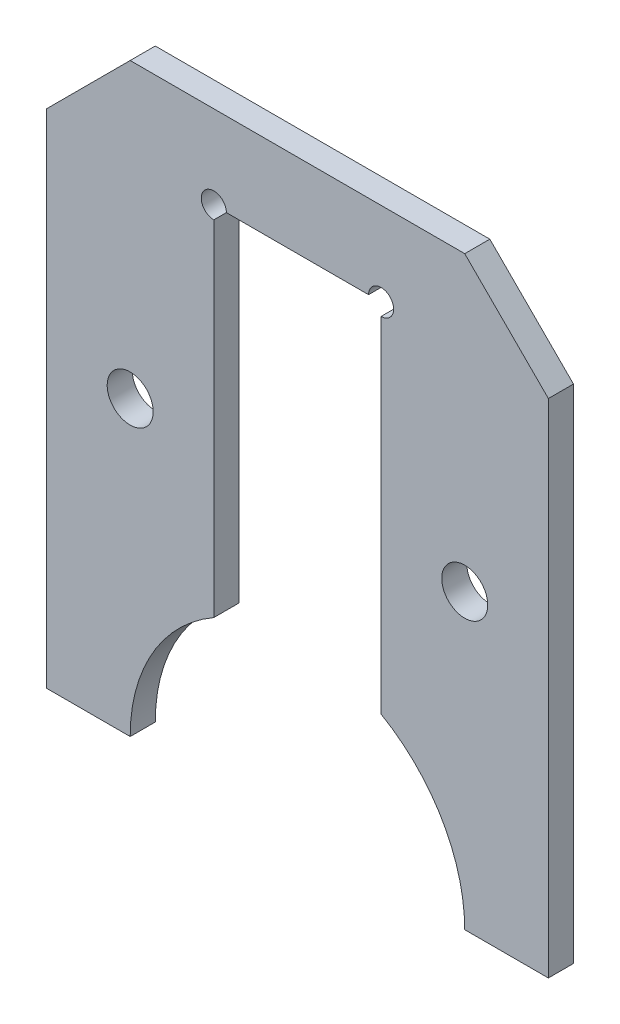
ISO-10303-21;
HEADER;
FILE_DESCRIPTION(('STEP AP214'),'2;1');
FILE_NAME('part.step','',(''),(''),'','','');
FILE_SCHEMA(('AUTOMOTIVE_DESIGN { 1 0 10303 214 1 1 1 1 }'));
ENDSEC;
DATA;
#1=APPLICATION_CONTEXT('core data for automotive mechanical design processes');
#2=APPLICATION_PROTOCOL_DEFINITION('international standard','automotive_design',2000,#1);
#3=PRODUCT_CONTEXT('',#1,'mechanical');
#4=PRODUCT('Part','Part','',(#3));
#5=PRODUCT_RELATED_PRODUCT_CATEGORY('part','',(#4));
#6=PRODUCT_DEFINITION_FORMATION('','',#4);
#7=PRODUCT_DEFINITION_CONTEXT('part definition',#1,'design');
#8=PRODUCT_DEFINITION('design','',#6,#7);
#9=PRODUCT_DEFINITION_SHAPE('','',#8);
#10=(LENGTH_UNIT() NAMED_UNIT(*) SI_UNIT(.MILLI.,.METRE.));
#11=(NAMED_UNIT(*) PLANE_ANGLE_UNIT() SI_UNIT($,.RADIAN.));
#12=(NAMED_UNIT(*) SI_UNIT($,.STERADIAN.) SOLID_ANGLE_UNIT());
#13=UNCERTAINTY_MEASURE_WITH_UNIT(LENGTH_MEASURE(1.E-05),#10,'distance_accuracy_value','');
#14=(GEOMETRIC_REPRESENTATION_CONTEXT(3) GLOBAL_UNCERTAINTY_ASSIGNED_CONTEXT((#13)) GLOBAL_UNIT_ASSIGNED_CONTEXT((#10,
#11,#12)) REPRESENTATION_CONTEXT('',''));
#15=CARTESIAN_POINT('',(0.,0.,0.));
#16=DIRECTION('',(0.,0.,1.));
#17=DIRECTION('',(1.,0.,0.));
#18=AXIS2_PLACEMENT_3D('',#15,#16,#17);
#19=CARTESIAN_POINT('',(0.,0.,3.));
#20=DIRECTION('',(0.,0.,1.));
#21=DIRECTION('',(1.,0.,0.));
#22=AXIS2_PLACEMENT_3D('',#19,#20,#21);
#23=PLANE('',#22);
#24=CARTESIAN_POINT('',(20.,35.,3.));
#25=DIRECTION('',(0.,0.,1.));
#26=DIRECTION('',(1.,0.,0.));
#27=AXIS2_PLACEMENT_3D('',#24,#25,#26);
#28=CIRCLE('',#27,2.75);
#29=CARTESIAN_POINT('',(22.75,35.,3.));
#30=VERTEX_POINT('',#29);
#31=EDGE_CURVE('E168',#30,#30,#28,.T.);
#32=ORIENTED_EDGE('',*,*,#31,.F.);
#33=EDGE_LOOP('',(#32));
#34=FACE_BOUND('',#33,.T.);
#35=CARTESIAN_POINT('',(0.,0.,3.));
#36=DIRECTION('',(0.,0.,-1.));
#37=DIRECTION('',(1.,0.,0.));
#38=AXIS2_PLACEMENT_3D('',#35,#36,#37);
#39=CIRCLE('',#38,20.);
#40=CARTESIAN_POINT('',(10.,17.3205080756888,3.));
#41=VERTEX_POINT('',#40);
#42=CARTESIAN_POINT('',(20.,0.,3.));
#43=VERTEX_POINT('',#42);
#44=EDGE_CURVE('E191',#41,#43,#39,.T.);
#45=ORIENTED_EDGE('',*,*,#44,.T.);
#46=DIRECTION('',(1.,0.,0.));
#47=VECTOR('',#46,1.);
#48=CARTESIAN_POINT('',(30.,0.,3.));
#49=LINE('',#48,#47);
#50=CARTESIAN_POINT('',(30.,0.,3.));
#51=VERTEX_POINT('',#50);
#52=EDGE_CURVE('E109',#43,#51,#49,.T.);
#53=ORIENTED_EDGE('',*,*,#52,.T.);
#54=DIRECTION('',(0.,1.,0.));
#55=VECTOR('',#54,1.);
#56=CARTESIAN_POINT('',(30.,60.,3.));
#57=LINE('',#56,#55);
#58=CARTESIAN_POINT('',(30.,60.,3.));
#59=VERTEX_POINT('',#58);
#60=EDGE_CURVE('E224',#51,#59,#57,.T.);
#61=ORIENTED_EDGE('',*,*,#60,.T.);
#62=DIRECTION('',(-0.707106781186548,0.707106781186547,0.));
#63=VECTOR('',#62,1.);
#64=CARTESIAN_POINT('',(20.,70.,3.));
#65=LINE('',#64,#63);
#66=CARTESIAN_POINT('',(20.,70.,3.));
#67=VERTEX_POINT('',#66);
#68=EDGE_CURVE('E243',#59,#67,#65,.T.);
#69=ORIENTED_EDGE('',*,*,#68,.T.);
#70=DIRECTION('',(-1.,0.,0.));
#71=VECTOR('',#70,1.);
#72=CARTESIAN_POINT('',(-20.,70.,3.));
#73=LINE('',#72,#71);
#74=CARTESIAN_POINT('',(-20.,70.,3.));
#75=VERTEX_POINT('',#74);
#76=EDGE_CURVE('E240',#67,#75,#73,.T.);
#77=ORIENTED_EDGE('',*,*,#76,.T.);
#78=DIRECTION('',(-0.707106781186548,-0.707106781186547,0.));
#79=VECTOR('',#78,1.);
#80=CARTESIAN_POINT('',(-20.,70.,3.));
#81=LINE('',#80,#79);
#82=CARTESIAN_POINT('',(-30.,60.,3.));
#83=VERTEX_POINT('',#82);
#84=EDGE_CURVE('E242',#75,#83,#81,.T.);
#85=ORIENTED_EDGE('',*,*,#84,.T.);
#86=DIRECTION('',(0.,-1.,0.));
#87=VECTOR('',#86,1.);
#88=CARTESIAN_POINT('',(-30.,60.,3.));
#89=LINE('',#88,#87);
#90=CARTESIAN_POINT('',(-30.,0.,3.));
#91=VERTEX_POINT('',#90);
#92=EDGE_CURVE('E245',#83,#91,#89,.T.);
#93=ORIENTED_EDGE('',*,*,#92,.T.);
#94=DIRECTION('',(1.,0.,0.));
#95=VECTOR('',#94,1.);
#96=CARTESIAN_POINT('',(-30.,0.,3.));
#97=LINE('',#96,#95);
#98=CARTESIAN_POINT('',(-20.,0.,3.));
#99=VERTEX_POINT('',#98);
#100=EDGE_CURVE('E251',#91,#99,#97,.T.);
#101=ORIENTED_EDGE('',*,*,#100,.T.);
#102=CARTESIAN_POINT('',(0.,0.,3.));
#103=DIRECTION('',(0.,0.,-1.));
#104=DIRECTION('',(-1.,0.,0.));
#105=AXIS2_PLACEMENT_3D('',#102,#103,#104);
#106=CIRCLE('',#105,20.);
#107=CARTESIAN_POINT('',(-10.,17.3205080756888,3.));
#108=VERTEX_POINT('',#107);
#109=EDGE_CURVE('E253',#99,#108,#106,.T.);
#110=ORIENTED_EDGE('',*,*,#109,.T.);
#111=DIRECTION('',(0.,1.,0.));
#112=VECTOR('',#111,1.);
#113=CARTESIAN_POINT('',(-10.,17.3205080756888,3.));
#114=LINE('',#113,#112);
#115=CARTESIAN_POINT('',(-10.,58.5,3.));
#116=VERTEX_POINT('',#115);
#117=EDGE_CURVE('E255',#108,#116,#114,.T.);
#118=ORIENTED_EDGE('',*,*,#117,.T.);
#119=CARTESIAN_POINT('',(-10.,60.,3.));
#120=DIRECTION('',(0.,0.,-1.));
#121=DIRECTION('',(-1.,0.,0.));
#122=AXIS2_PLACEMENT_3D('',#119,#120,#121);
#123=CIRCLE('',#122,1.5);
#124=CARTESIAN_POINT('',(-8.5,60.,3.));
#125=VERTEX_POINT('',#124);
#126=EDGE_CURVE('E146',#116,#125,#123,.T.);
#127=ORIENTED_EDGE('',*,*,#126,.T.);
#128=DIRECTION('',(1.,0.,0.));
#129=VECTOR('',#128,1.);
#130=CARTESIAN_POINT('',(8.5,60.,3.));
#131=LINE('',#130,#129);
#132=CARTESIAN_POINT('',(8.5,60.,3.));
#133=VERTEX_POINT('',#132);
#134=EDGE_CURVE('E140',#125,#133,#131,.T.);
#135=ORIENTED_EDGE('',*,*,#134,.T.);
#136=CARTESIAN_POINT('',(10.,60.,3.));
#137=DIRECTION('',(0.,0.,-1.));
#138=DIRECTION('',(1.,0.,0.));
#139=AXIS2_PLACEMENT_3D('',#136,#137,#138);
#140=CIRCLE('',#139,1.5);
#141=CARTESIAN_POINT('',(10.,58.5,3.));
#142=VERTEX_POINT('',#141);
#143=EDGE_CURVE('E144',#133,#142,#140,.T.);
#144=ORIENTED_EDGE('',*,*,#143,.T.);
#145=DIRECTION('',(0.,-1.,0.));
#146=VECTOR('',#145,1.);
#147=CARTESIAN_POINT('',(10.,17.3205080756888,3.));
#148=LINE('',#147,#146);
#149=EDGE_CURVE('E48',#142,#41,#148,.T.);
#150=ORIENTED_EDGE('',*,*,#149,.T.);
#151=EDGE_LOOP('',(#45,#53,#61,#69,#77,#85,#93,#101,#110,#118,#127,#135,#144,#150));
#152=FACE_BOUND('',#151,.T.);
#153=CARTESIAN_POINT('',(-20.,35.,3.));
#154=DIRECTION('',(0.,0.,1.));
#155=DIRECTION('',(-1.,0.,0.));
#156=AXIS2_PLACEMENT_3D('',#153,#154,#155);
#157=CIRCLE('',#156,2.75);
#158=CARTESIAN_POINT('',(-22.75,35.,3.));
#159=VERTEX_POINT('',#158);
#160=EDGE_CURVE('E298',#159,#159,#157,.T.);
#161=ORIENTED_EDGE('',*,*,#160,.F.);
#162=EDGE_LOOP('',(#161));
#163=FACE_BOUND('',#162,.T.);
#164=ADVANCED_FACE('F31',(#34,#152,#163),#23,.T.);
#165=CARTESIAN_POINT('',(0.,0.,0.));
#166=DIRECTION('',(0.,0.,1.));
#167=DIRECTION('',(1.,0.,0.));
#168=AXIS2_PLACEMENT_3D('',#165,#166,#167);
#169=PLANE('',#168);
#170=CARTESIAN_POINT('',(20.,35.,0.));
#171=DIRECTION('',(0.,0.,1.));
#172=DIRECTION('',(1.,0.,0.));
#173=AXIS2_PLACEMENT_3D('',#170,#171,#172);
#174=CIRCLE('',#173,2.75);
#175=CARTESIAN_POINT('',(22.75,35.,0.));
#176=VERTEX_POINT('',#175);
#177=EDGE_CURVE('E303',#176,#176,#174,.T.);
#178=ORIENTED_EDGE('',*,*,#177,.T.);
#179=EDGE_LOOP('',(#178));
#180=FACE_BOUND('',#179,.T.);
#181=CARTESIAN_POINT('',(0.,0.,0.));
#182=DIRECTION('',(0.,0.,-1.));
#183=DIRECTION('',(1.,0.,0.));
#184=AXIS2_PLACEMENT_3D('',#181,#182,#183);
#185=CIRCLE('',#184,20.);
#186=CARTESIAN_POINT('',(10.,17.3205080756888,0.));
#187=VERTEX_POINT('',#186);
#188=CARTESIAN_POINT('',(20.,0.,0.));
#189=VERTEX_POINT('',#188);
#190=EDGE_CURVE('E164',#187,#189,#185,.T.);
#191=ORIENTED_EDGE('',*,*,#190,.F.);
#192=DIRECTION('',(0.,-1.,0.));
#193=VECTOR('',#192,1.);
#194=CARTESIAN_POINT('',(10.,17.3205080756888,0.));
#195=LINE('',#194,#193);
#196=CARTESIAN_POINT('',(10.,58.5,0.));
#197=VERTEX_POINT('',#196);
#198=EDGE_CURVE('E101',#197,#187,#195,.T.);
#199=ORIENTED_EDGE('',*,*,#198,.F.);
#200=CARTESIAN_POINT('',(10.,60.,0.));
#201=DIRECTION('',(0.,0.,-1.));
#202=DIRECTION('',(1.,0.,0.));
#203=AXIS2_PLACEMENT_3D('',#200,#201,#202);
#204=CIRCLE('',#203,1.5);
#205=CARTESIAN_POINT('',(8.5,60.,0.));
#206=VERTEX_POINT('',#205);
#207=EDGE_CURVE('E95',#206,#197,#204,.T.);
#208=ORIENTED_EDGE('',*,*,#207,.F.);
#209=DIRECTION('',(1.,0.,0.));
#210=VECTOR('',#209,1.);
#211=CARTESIAN_POINT('',(8.5,60.,0.));
#212=LINE('',#211,#210);
#213=CARTESIAN_POINT('',(-8.5,60.,0.));
#214=VERTEX_POINT('',#213);
#215=EDGE_CURVE('E154',#214,#206,#212,.T.);
#216=ORIENTED_EDGE('',*,*,#215,.F.);
#217=CARTESIAN_POINT('',(-10.,60.,0.));
#218=DIRECTION('',(0.,0.,-1.));
#219=DIRECTION('',(-1.,0.,0.));
#220=AXIS2_PLACEMENT_3D('',#217,#218,#219);
#221=CIRCLE('',#220,1.5);
#222=CARTESIAN_POINT('',(-10.,58.5,0.));
#223=VERTEX_POINT('',#222);
#224=EDGE_CURVE('E186',#223,#214,#221,.T.);
#225=ORIENTED_EDGE('',*,*,#224,.F.);
#226=DIRECTION('',(0.,1.,0.));
#227=VECTOR('',#226,1.);
#228=CARTESIAN_POINT('',(-10.,17.3205080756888,0.));
#229=LINE('',#228,#227);
#230=CARTESIAN_POINT('',(-10.,17.3205080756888,0.));
#231=VERTEX_POINT('',#230);
#232=EDGE_CURVE('E184',#231,#223,#229,.T.);
#233=ORIENTED_EDGE('',*,*,#232,.F.);
#234=CARTESIAN_POINT('',(0.,0.,0.));
#235=DIRECTION('',(0.,0.,-1.));
#236=DIRECTION('',(-1.,0.,0.));
#237=AXIS2_PLACEMENT_3D('',#234,#235,#236);
#238=CIRCLE('',#237,20.);
#239=CARTESIAN_POINT('',(-20.,0.,0.));
#240=VERTEX_POINT('',#239);
#241=EDGE_CURVE('E182',#240,#231,#238,.T.);
#242=ORIENTED_EDGE('',*,*,#241,.F.);
#243=DIRECTION('',(1.,0.,0.));
#244=VECTOR('',#243,1.);
#245=CARTESIAN_POINT('',(-30.,0.,0.));
#246=LINE('',#245,#244);
#247=CARTESIAN_POINT('',(-30.,0.,0.));
#248=VERTEX_POINT('',#247);
#249=EDGE_CURVE('E180',#248,#240,#246,.T.);
#250=ORIENTED_EDGE('',*,*,#249,.F.);
#251=DIRECTION('',(0.,-1.,0.));
#252=VECTOR('',#251,1.);
#253=CARTESIAN_POINT('',(-30.,60.,0.));
#254=LINE('',#253,#252);
#255=CARTESIAN_POINT('',(-30.,60.,0.));
#256=VERTEX_POINT('',#255);
#257=EDGE_CURVE('E178',#256,#248,#254,.T.);
#258=ORIENTED_EDGE('',*,*,#257,.F.);
#259=DIRECTION('',(-0.707106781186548,-0.707106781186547,0.));
#260=VECTOR('',#259,1.);
#261=CARTESIAN_POINT('',(-20.,70.,0.));
#262=LINE('',#261,#260);
#263=CARTESIAN_POINT('',(-20.,70.,0.));
#264=VERTEX_POINT('',#263);
#265=EDGE_CURVE('E176',#264,#256,#262,.T.);
#266=ORIENTED_EDGE('',*,*,#265,.F.);
#267=DIRECTION('',(-1.,0.,0.));
#268=VECTOR('',#267,1.);
#269=CARTESIAN_POINT('',(-20.,70.,0.));
#270=LINE('',#269,#268);
#271=CARTESIAN_POINT('',(20.,70.,0.));
#272=VERTEX_POINT('',#271);
#273=EDGE_CURVE('E174',#272,#264,#270,.T.);
#274=ORIENTED_EDGE('',*,*,#273,.F.);
#275=DIRECTION('',(-0.707106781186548,0.707106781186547,0.));
#276=VECTOR('',#275,1.);
#277=CARTESIAN_POINT('',(20.,70.,0.));
#278=LINE('',#277,#276);
#279=CARTESIAN_POINT('',(30.,60.,0.));
#280=VERTEX_POINT('',#279);
#281=EDGE_CURVE('E172',#280,#272,#278,.T.);
#282=ORIENTED_EDGE('',*,*,#281,.F.);
#283=DIRECTION('',(0.,1.,0.));
#284=VECTOR('',#283,1.);
#285=CARTESIAN_POINT('',(30.,60.,0.));
#286=LINE('',#285,#284);
#287=CARTESIAN_POINT('',(30.,0.,0.));
#288=VERTEX_POINT('',#287);
#289=EDGE_CURVE('E170',#288,#280,#286,.T.);
#290=ORIENTED_EDGE('',*,*,#289,.F.);
#291=DIRECTION('',(1.,0.,0.));
#292=VECTOR('',#291,1.);
#293=CARTESIAN_POINT('',(30.,0.,0.));
#294=LINE('',#293,#292);
#295=EDGE_CURVE('E167',#189,#288,#294,.T.);
#296=ORIENTED_EDGE('',*,*,#295,.F.);
#297=EDGE_LOOP('',(#191,#199,#208,#216,#225,#233,#242,#250,#258,#266,#274,#282,#290,#296));
#298=FACE_BOUND('',#297,.T.);
#299=CARTESIAN_POINT('',(-20.,35.,0.));
#300=DIRECTION('',(0.,0.,1.));
#301=DIRECTION('',(-1.,0.,0.));
#302=AXIS2_PLACEMENT_3D('',#299,#300,#301);
#303=CIRCLE('',#302,2.75);
#304=CARTESIAN_POINT('',(-22.75,35.,0.));
#305=VERTEX_POINT('',#304);
#306=EDGE_CURVE('E301',#305,#305,#303,.T.);
#307=ORIENTED_EDGE('',*,*,#306,.T.);
#308=EDGE_LOOP('',(#307));
#309=FACE_BOUND('',#308,.T.);
#310=ADVANCED_FACE('F228',(#180,#298,#309),#169,.F.);
#311=CARTESIAN_POINT('',(0.,0.,3.));
#312=DIRECTION('',(0.,0.,-1.));
#313=DIRECTION('',(-1.,0.,0.));
#314=AXIS2_PLACEMENT_3D('',#311,#312,#313);
#315=CYLINDRICAL_SURFACE('',#314,20.);
#316=ORIENTED_EDGE('',*,*,#190,.T.);
#317=DIRECTION('',(0.,0.,-1.));
#318=VECTOR('',#317,1.);
#319=CARTESIAN_POINT('',(20.,0.,3.));
#320=LINE('',#319,#318);
#321=EDGE_CURVE('E11',#43,#189,#320,.T.);
#322=ORIENTED_EDGE('',*,*,#321,.F.);
#323=ORIENTED_EDGE('',*,*,#44,.F.);
#324=DIRECTION('',(0.,0.,-1.));
#325=VECTOR('',#324,1.);
#326=CARTESIAN_POINT('',(10.,17.3205080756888,3.));
#327=LINE('',#326,#325);
#328=EDGE_CURVE('E160',#41,#187,#327,.T.);
#329=ORIENTED_EDGE('',*,*,#328,.T.);
#330=EDGE_LOOP('',(#316,#322,#323,#329));
#331=FACE_BOUND('',#330,.T.);
#332=ADVANCED_FACE('F33',(#331),#315,.F.);
#333=CARTESIAN_POINT('',(30.,0.,3.));
#334=DIRECTION('',(0.,1.,0.));
#335=DIRECTION('',(-1.,0.,0.));
#336=AXIS2_PLACEMENT_3D('',#333,#334,#335);
#337=PLANE('',#336);
#338=ORIENTED_EDGE('',*,*,#295,.T.);
#339=DIRECTION('',(0.,0.,-1.));
#340=VECTOR('',#339,1.);
#341=CARTESIAN_POINT('',(30.,0.,3.));
#342=LINE('',#341,#340);
#343=EDGE_CURVE('E40',#51,#288,#342,.T.);
#344=ORIENTED_EDGE('',*,*,#343,.F.);
#345=ORIENTED_EDGE('',*,*,#52,.F.);
#346=ORIENTED_EDGE('',*,*,#321,.T.);
#347=EDGE_LOOP('',(#338,#344,#345,#346));
#348=FACE_BOUND('',#347,.T.);
#349=ADVANCED_FACE('F416',(#348),#337,.F.);
#350=CARTESIAN_POINT('',(30.,60.,3.));
#351=DIRECTION('',(-1.,0.,0.));
#352=DIRECTION('',(0.,-1.,0.));
#353=AXIS2_PLACEMENT_3D('',#350,#351,#352);
#354=PLANE('',#353);
#355=ORIENTED_EDGE('',*,*,#289,.T.);
#356=DIRECTION('',(0.,0.,-1.));
#357=VECTOR('',#356,1.);
#358=CARTESIAN_POINT('',(30.,60.,3.));
#359=LINE('',#358,#357);
#360=EDGE_CURVE('E216',#59,#280,#359,.T.);
#361=ORIENTED_EDGE('',*,*,#360,.F.);
#362=ORIENTED_EDGE('',*,*,#60,.F.);
#363=ORIENTED_EDGE('',*,*,#343,.T.);
#364=EDGE_LOOP('',(#355,#361,#362,#363));
#365=FACE_BOUND('',#364,.T.);
#366=ADVANCED_FACE('F222',(#365),#354,.F.);
#367=CARTESIAN_POINT('',(20.,70.,3.));
#368=DIRECTION('',(-0.707106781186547,-0.707106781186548,0.));
#369=DIRECTION('',(0.707106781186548,-0.707106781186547,0.));
#370=AXIS2_PLACEMENT_3D('',#367,#368,#369);
#371=PLANE('',#370);
#372=ORIENTED_EDGE('',*,*,#281,.T.);
#373=DIRECTION('',(0.,0.,-1.));
#374=VECTOR('',#373,1.);
#375=CARTESIAN_POINT('',(20.,70.,3.));
#376=LINE('',#375,#374);
#377=EDGE_CURVE('E213',#67,#272,#376,.T.);
#378=ORIENTED_EDGE('',*,*,#377,.F.);
#379=ORIENTED_EDGE('',*,*,#68,.F.);
#380=ORIENTED_EDGE('',*,*,#360,.T.);
#381=EDGE_LOOP('',(#372,#378,#379,#380));
#382=FACE_BOUND('',#381,.T.);
#383=ADVANCED_FACE('F234',(#382),#371,.F.);
#384=CARTESIAN_POINT('',(-20.,70.,3.));
#385=DIRECTION('',(0.,-1.,0.));
#386=DIRECTION('',(0.,0.,-1.));
#387=AXIS2_PLACEMENT_3D('',#384,#385,#386);
#388=PLANE('',#387);
#389=ORIENTED_EDGE('',*,*,#273,.T.);
#390=DIRECTION('',(0.,0.,-1.));
#391=VECTOR('',#390,1.);
#392=CARTESIAN_POINT('',(-20.,70.,3.));
#393=LINE('',#392,#391);
#394=EDGE_CURVE('E210',#75,#264,#393,.T.);
#395=ORIENTED_EDGE('',*,*,#394,.F.);
#396=ORIENTED_EDGE('',*,*,#76,.F.);
#397=ORIENTED_EDGE('',*,*,#377,.T.);
#398=EDGE_LOOP('',(#389,#395,#396,#397));
#399=FACE_BOUND('',#398,.T.);
#400=ADVANCED_FACE('F238',(#399),#388,.F.);
#401=CARTESIAN_POINT('',(-20.,70.,3.));
#402=DIRECTION('',(0.707106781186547,-0.707106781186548,0.));
#403=DIRECTION('',(0.707106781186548,0.707106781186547,0.));
#404=AXIS2_PLACEMENT_3D('',#401,#402,#403);
#405=PLANE('',#404);
#406=ORIENTED_EDGE('',*,*,#265,.T.);
#407=DIRECTION('',(0.,0.,-1.));
#408=VECTOR('',#407,1.);
#409=CARTESIAN_POINT('',(-30.,60.,3.));
#410=LINE('',#409,#408);
#411=EDGE_CURVE('E207',#83,#256,#410,.T.);
#412=ORIENTED_EDGE('',*,*,#411,.F.);
#413=ORIENTED_EDGE('',*,*,#84,.F.);
#414=ORIENTED_EDGE('',*,*,#394,.T.);
#415=EDGE_LOOP('',(#406,#412,#413,#414));
#416=FACE_BOUND('',#415,.T.);
#417=ADVANCED_FACE('F381',(#416),#405,.F.);
#418=CARTESIAN_POINT('',(-30.,60.,3.));
#419=DIRECTION('',(1.,0.,0.));
#420=DIRECTION('',(0.,1.,0.));
#421=AXIS2_PLACEMENT_3D('',#418,#419,#420);
#422=PLANE('',#421);
#423=ORIENTED_EDGE('',*,*,#257,.T.);
#424=DIRECTION('',(0.,0.,-1.));
#425=VECTOR('',#424,1.);
#426=CARTESIAN_POINT('',(-30.,0.,3.));
#427=LINE('',#426,#425);
#428=EDGE_CURVE('E204',#91,#248,#427,.T.);
#429=ORIENTED_EDGE('',*,*,#428,.F.);
#430=ORIENTED_EDGE('',*,*,#92,.F.);
#431=ORIENTED_EDGE('',*,*,#411,.T.);
#432=EDGE_LOOP('',(#423,#429,#430,#431));
#433=FACE_BOUND('',#432,.T.);
#434=ADVANCED_FACE('F371',(#433),#422,.F.);
#435=CARTESIAN_POINT('',(-30.,0.,3.));
#436=DIRECTION('',(0.,1.,0.));
#437=DIRECTION('',(-1.,0.,0.));
#438=AXIS2_PLACEMENT_3D('',#435,#436,#437);
#439=PLANE('',#438);
#440=ORIENTED_EDGE('',*,*,#249,.T.);
#441=DIRECTION('',(0.,0.,-1.));
#442=VECTOR('',#441,1.);
#443=CARTESIAN_POINT('',(-20.,0.,3.));
#444=LINE('',#443,#442);
#445=EDGE_CURVE('E201',#99,#240,#444,.T.);
#446=ORIENTED_EDGE('',*,*,#445,.F.);
#447=ORIENTED_EDGE('',*,*,#100,.F.);
#448=ORIENTED_EDGE('',*,*,#428,.T.);
#449=EDGE_LOOP('',(#440,#446,#447,#448));
#450=FACE_BOUND('',#449,.T.);
#451=ADVANCED_FACE('F361',(#450),#439,.F.);
#452=CARTESIAN_POINT('',(0.,0.,3.));
#453=DIRECTION('',(0.,0.,-1.));
#454=DIRECTION('',(-1.,0.,0.));
#455=AXIS2_PLACEMENT_3D('',#452,#453,#454);
#456=CYLINDRICAL_SURFACE('',#455,20.);
#457=ORIENTED_EDGE('',*,*,#241,.T.);
#458=DIRECTION('',(0.,0.,-1.));
#459=VECTOR('',#458,1.);
#460=CARTESIAN_POINT('',(-10.,17.3205080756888,3.));
#461=LINE('',#460,#459);
#462=EDGE_CURVE('E198',#108,#231,#461,.T.);
#463=ORIENTED_EDGE('',*,*,#462,.F.);
#464=ORIENTED_EDGE('',*,*,#109,.F.);
#465=ORIENTED_EDGE('',*,*,#445,.T.);
#466=EDGE_LOOP('',(#457,#463,#464,#465));
#467=FACE_BOUND('',#466,.T.);
#468=ADVANCED_FACE('F352',(#467),#456,.F.);
#469=CARTESIAN_POINT('',(-10.,17.3205080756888,3.));
#470=DIRECTION('',(-1.,0.,0.));
#471=DIRECTION('',(0.,0.,1.));
#472=AXIS2_PLACEMENT_3D('',#469,#470,#471);
#473=PLANE('',#472);
#474=ORIENTED_EDGE('',*,*,#232,.T.);
#475=DIRECTION('',(0.,0.,-1.));
#476=VECTOR('',#475,1.);
#477=CARTESIAN_POINT('',(-10.,58.5,3.));
#478=LINE('',#477,#476);
#479=EDGE_CURVE('E195',#116,#223,#478,.T.);
#480=ORIENTED_EDGE('',*,*,#479,.F.);
#481=ORIENTED_EDGE('',*,*,#117,.F.);
#482=ORIENTED_EDGE('',*,*,#462,.T.);
#483=EDGE_LOOP('',(#474,#480,#481,#482));
#484=FACE_BOUND('',#483,.T.);
#485=ADVANCED_FACE('F261',(#484),#473,.F.);
#486=CARTESIAN_POINT('',(-10.,60.,3.));
#487=DIRECTION('',(0.,0.,-1.));
#488=DIRECTION('',(-1.,0.,0.));
#489=AXIS2_PLACEMENT_3D('',#486,#487,#488);
#490=CYLINDRICAL_SURFACE('',#489,1.5);
#491=ORIENTED_EDGE('',*,*,#224,.T.);
#492=DIRECTION('',(0.,0.,-1.));
#493=VECTOR('',#492,1.);
#494=CARTESIAN_POINT('',(-8.5,60.,3.));
#495=LINE('',#494,#493);
#496=EDGE_CURVE('E155',#125,#214,#495,.T.);
#497=ORIENTED_EDGE('',*,*,#496,.F.);
#498=ORIENTED_EDGE('',*,*,#126,.F.);
#499=ORIENTED_EDGE('',*,*,#479,.T.);
#500=EDGE_LOOP('',(#491,#497,#498,#499));
#501=FACE_BOUND('',#500,.T.);
#502=ADVANCED_FACE('F265',(#501),#490,.F.);
#503=CARTESIAN_POINT('',(8.5,60.,3.));
#504=DIRECTION('',(0.,1.,0.));
#505=DIRECTION('',(0.,0.,1.));
#506=AXIS2_PLACEMENT_3D('',#503,#504,#505);
#507=PLANE('',#506);
#508=ORIENTED_EDGE('',*,*,#215,.T.);
#509=DIRECTION('',(0.,0.,-1.));
#510=VECTOR('',#509,1.);
#511=CARTESIAN_POINT('',(8.5,60.,3.));
#512=LINE('',#511,#510);
#513=EDGE_CURVE('E151',#133,#206,#512,.T.);
#514=ORIENTED_EDGE('',*,*,#513,.F.);
#515=ORIENTED_EDGE('',*,*,#134,.F.);
#516=ORIENTED_EDGE('',*,*,#496,.T.);
#517=EDGE_LOOP('',(#508,#514,#515,#516));
#518=FACE_BOUND('',#517,.T.);
#519=ADVANCED_FACE('F152',(#518),#507,.F.);
#520=CARTESIAN_POINT('',(10.,60.,3.));
#521=DIRECTION('',(0.,0.,-1.));
#522=DIRECTION('',(-1.,0.,0.));
#523=AXIS2_PLACEMENT_3D('',#520,#521,#522);
#524=CYLINDRICAL_SURFACE('',#523,1.5);
#525=ORIENTED_EDGE('',*,*,#207,.T.);
#526=DIRECTION('',(0.,0.,-1.));
#527=VECTOR('',#526,1.);
#528=CARTESIAN_POINT('',(10.,58.5,3.));
#529=LINE('',#528,#527);
#530=EDGE_CURVE('E156',#142,#197,#529,.T.);
#531=ORIENTED_EDGE('',*,*,#530,.F.);
#532=ORIENTED_EDGE('',*,*,#143,.F.);
#533=ORIENTED_EDGE('',*,*,#513,.T.);
#534=EDGE_LOOP('',(#525,#531,#532,#533));
#535=FACE_BOUND('',#534,.T.);
#536=ADVANCED_FACE('F158',(#535),#524,.F.);
#537=CARTESIAN_POINT('',(10.,17.3205080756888,3.));
#538=DIRECTION('',(1.,0.,0.));
#539=DIRECTION('',(0.,0.,-1.));
#540=AXIS2_PLACEMENT_3D('',#537,#538,#539);
#541=PLANE('',#540);
#542=ORIENTED_EDGE('',*,*,#198,.T.);
#543=ORIENTED_EDGE('',*,*,#328,.F.);
#544=ORIENTED_EDGE('',*,*,#149,.F.);
#545=ORIENTED_EDGE('',*,*,#530,.T.);
#546=EDGE_LOOP('',(#542,#543,#544,#545));
#547=FACE_BOUND('',#546,.T.);
#548=ADVANCED_FACE('F269',(#547),#541,.F.);
#549=CARTESIAN_POINT('',(20.,35.,3.));
#550=DIRECTION('',(0.,0.,-1.));
#551=DIRECTION('',(-1.,0.,0.));
#552=AXIS2_PLACEMENT_3D('',#549,#550,#551);
#553=CYLINDRICAL_SURFACE('',#552,2.75);
#554=ORIENTED_EDGE('',*,*,#31,.T.);
#555=EDGE_LOOP('',(#554));
#556=FACE_BOUND('',#555,.T.);
#557=ORIENTED_EDGE('',*,*,#177,.F.);
#558=EDGE_LOOP('',(#557));
#559=FACE_BOUND('',#558,.T.);
#560=ADVANCED_FACE('F271',(#556,#559),#553,.F.);
#561=CARTESIAN_POINT('',(-20.,35.,3.));
#562=DIRECTION('',(0.,0.,-1.));
#563=DIRECTION('',(-1.,0.,0.));
#564=AXIS2_PLACEMENT_3D('',#561,#562,#563);
#565=CYLINDRICAL_SURFACE('',#564,2.75);
#566=ORIENTED_EDGE('',*,*,#160,.T.);
#567=EDGE_LOOP('',(#566));
#568=FACE_BOUND('',#567,.T.);
#569=ORIENTED_EDGE('',*,*,#306,.F.);
#570=EDGE_LOOP('',(#569));
#571=FACE_BOUND('',#570,.T.);
#572=ADVANCED_FACE('F277',(#568,#571),#565,.F.);
#573=CLOSED_SHELL('',(#164,#310,#332,#349,#366,#383,#400,#417,#434,#451,#468,#485,#502,#519,
#536,#548,#560,#572));
#574=MANIFOLD_SOLID_BREP('B2',#573);
#575=ADVANCED_BREP_SHAPE_REPRESENTATION('',(#18,#574),#14);
#576=SHAPE_DEFINITION_REPRESENTATION(#9,#575);
ENDSEC;
END-ISO-10303-21;
